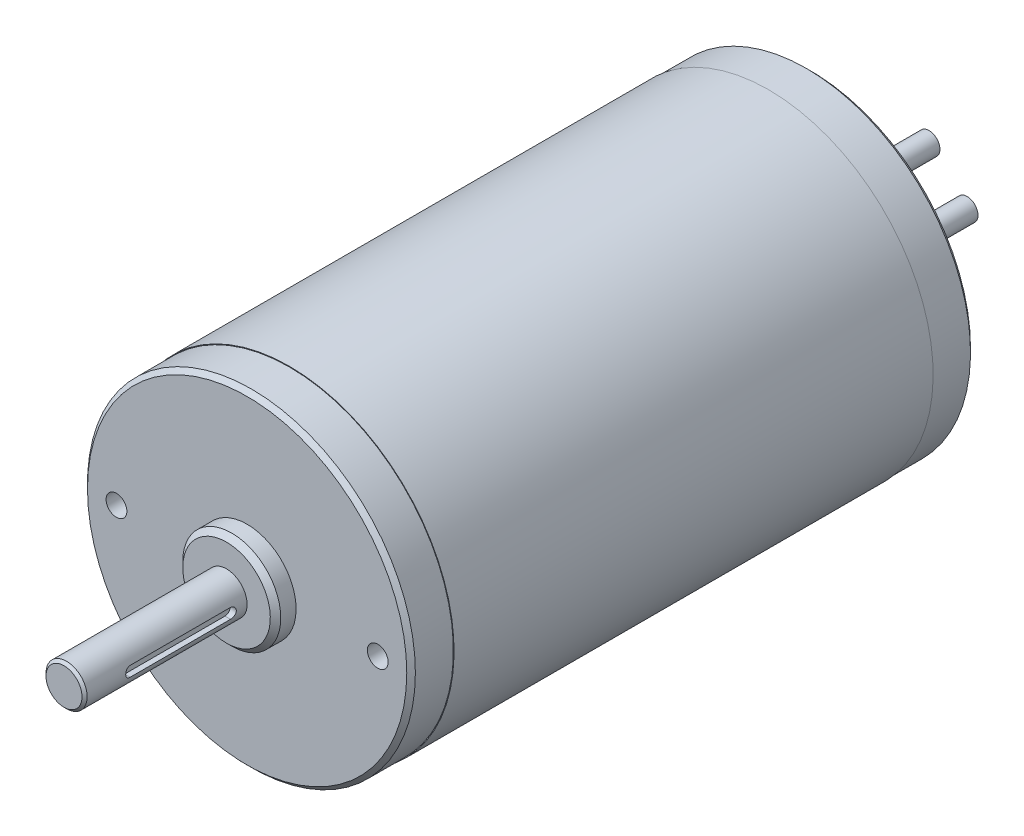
ISO-10303-21;
HEADER;
FILE_DESCRIPTION(('STEP AP214'),'2;1');
FILE_NAME('part.step','',(''),(''),'','','');
FILE_SCHEMA(('AUTOMOTIVE_DESIGN { 1 0 10303 214 1 1 1 1 }'));
ENDSEC;
DATA;
#1=APPLICATION_CONTEXT('core data for automotive mechanical design processes');
#2=APPLICATION_PROTOCOL_DEFINITION('international standard','automotive_design',2000,#1);
#3=PRODUCT_CONTEXT('',#1,'mechanical');
#4=PRODUCT('Part','Part','',(#3));
#5=PRODUCT_RELATED_PRODUCT_CATEGORY('part','',(#4));
#6=PRODUCT_DEFINITION_FORMATION('','',#4);
#7=PRODUCT_DEFINITION_CONTEXT('part definition',#1,'design');
#8=PRODUCT_DEFINITION('design','',#6,#7);
#9=PRODUCT_DEFINITION_SHAPE('','',#8);
#10=(LENGTH_UNIT() NAMED_UNIT(*) SI_UNIT(.MILLI.,.METRE.));
#11=(NAMED_UNIT(*) PLANE_ANGLE_UNIT() SI_UNIT($,.RADIAN.));
#12=(NAMED_UNIT(*) SI_UNIT($,.STERADIAN.) SOLID_ANGLE_UNIT());
#13=UNCERTAINTY_MEASURE_WITH_UNIT(LENGTH_MEASURE(1.E-05),#10,'distance_accuracy_value','');
#14=(GEOMETRIC_REPRESENTATION_CONTEXT(3) GLOBAL_UNCERTAINTY_ASSIGNED_CONTEXT((#13)) GLOBAL_UNIT_ASSIGNED_CONTEXT((#10,
#11,#12)) REPRESENTATION_CONTEXT('',''));
#15=CARTESIAN_POINT('',(0.,0.,0.));
#16=DIRECTION('',(0.,0.,1.));
#17=DIRECTION('',(1.,0.,0.));
#18=AXIS2_PLACEMENT_3D('',#15,#16,#17);
#19=CARTESIAN_POINT('',(18.6070906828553,11.2073596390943,-121.3729));
#20=DIRECTION('',(0.,0.,-1.));
#21=DIRECTION('',(0.,-1.,0.));
#22=AXIS2_PLACEMENT_3D('',#19,#20,#21);
#23=PLANE('',#22);
#24=CARTESIAN_POINT('',(11.2073596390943,18.6070906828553,-121.3729));
#25=DIRECTION('',(0.,0.,-1.));
#26=DIRECTION('',(0.,1.,0.));
#27=AXIS2_PLACEMENT_3D('',#24,#25,#26);
#28=CIRCLE('',#27,2.118);
#29=CARTESIAN_POINT('',(11.2073596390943,20.7250906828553,-121.3729));
#30=VERTEX_POINT('',#29);
#31=EDGE_CURVE('E11',#30,#30,#28,.T.);
#32=ORIENTED_EDGE('',*,*,#31,.T.);
#33=EDGE_LOOP('',(#32));
#34=FACE_BOUND('',#33,.T.);
#35=ADVANCED_FACE('F17',(#34),#23,.T.);
#36=CARTESIAN_POINT('',(11.2073596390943,18.6070906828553,-121.3729));
#37=DIRECTION('',(0.,0.,1.));
#38=DIRECTION('',(1.,0.,0.));
#39=AXIS2_PLACEMENT_3D('',#36,#37,#38);
#40=CYLINDRICAL_SURFACE('',#39,2.118);
#41=CARTESIAN_POINT('',(11.2073596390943,18.6070906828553,-111.8479));
#42=DIRECTION('',(0.,0.,-1.));
#43=DIRECTION('',(0.,1.,0.));
#44=AXIS2_PLACEMENT_3D('',#41,#42,#43);
#45=CIRCLE('',#44,2.118);
#46=CARTESIAN_POINT('',(11.2073596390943,20.7250906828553,-111.8479));
#47=VERTEX_POINT('',#46);
#48=EDGE_CURVE('E247',#47,#47,#45,.T.);
#49=ORIENTED_EDGE('',*,*,#48,.T.);
#50=EDGE_LOOP('',(#49));
#51=FACE_BOUND('',#50,.T.);
#52=ORIENTED_EDGE('',*,*,#31,.F.);
#53=EDGE_LOOP('',(#52));
#54=FACE_BOUND('',#53,.T.);
#55=ADVANCED_FACE('F424',(#51,#54),#40,.T.);
#56=CARTESIAN_POINT('',(18.6070906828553,11.2073596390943,-121.3729));
#57=DIRECTION('',(0.,0.,-1.));
#58=DIRECTION('',(0.,-1.,0.));
#59=AXIS2_PLACEMENT_3D('',#56,#57,#58);
#60=PLANE('',#59);
#61=CARTESIAN_POINT('',(18.6070906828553,11.2073596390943,-121.3729));
#62=DIRECTION('',(0.,0.,-1.));
#63=DIRECTION('',(0.,1.,0.));
#64=AXIS2_PLACEMENT_3D('',#61,#62,#63);
#65=CIRCLE('',#64,2.118);
#66=CARTESIAN_POINT('',(18.6070906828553,13.3253596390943,-121.3729));
#67=VERTEX_POINT('',#66);
#68=EDGE_CURVE('E26',#67,#67,#65,.T.);
#69=ORIENTED_EDGE('',*,*,#68,.T.);
#70=EDGE_LOOP('',(#69));
#71=FACE_BOUND('',#70,.T.);
#72=ADVANCED_FACE('F430',(#71),#60,.T.);
#73=CARTESIAN_POINT('',(18.6070906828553,11.2073596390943,-121.3729));
#74=DIRECTION('',(0.,0.,1.));
#75=DIRECTION('',(1.,0.,0.));
#76=AXIS2_PLACEMENT_3D('',#73,#74,#75);
#77=CYLINDRICAL_SURFACE('',#76,2.118);
#78=CARTESIAN_POINT('',(18.6070906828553,11.2073596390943,-111.8479));
#79=DIRECTION('',(0.,0.,-1.));
#80=DIRECTION('',(0.,1.,0.));
#81=AXIS2_PLACEMENT_3D('',#78,#79,#80);
#82=CIRCLE('',#81,2.118);
#83=CARTESIAN_POINT('',(18.6070906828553,13.3253596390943,-111.8479));
#84=VERTEX_POINT('',#83);
#85=EDGE_CURVE('E244',#84,#84,#82,.T.);
#86=ORIENTED_EDGE('',*,*,#85,.T.);
#87=EDGE_LOOP('',(#86));
#88=FACE_BOUND('',#87,.T.);
#89=ORIENTED_EDGE('',*,*,#68,.F.);
#90=EDGE_LOOP('',(#89));
#91=FACE_BOUND('',#90,.T.);
#92=ADVANCED_FACE('F436',(#88,#91),#77,.T.);
#93=CARTESIAN_POINT('',(0.,0.,-13.6144));
#94=DIRECTION('',(0.,0.,1.));
#95=DIRECTION('',(1.,0.,0.));
#96=AXIS2_PLACEMENT_3D('',#93,#94,#95);
#97=PLANE('',#96);
#98=CARTESIAN_POINT('',(-25.4,0.,-13.6144));
#99=DIRECTION('',(0.,0.,1.));
#100=DIRECTION('',(0.,-1.,0.));
#101=AXIS2_PLACEMENT_3D('',#98,#99,#100);
#102=CIRCLE('',#101,2.0193);
#103=CARTESIAN_POINT('',(-25.4,-2.0193,-13.6144));
#104=VERTEX_POINT('',#103);
#105=EDGE_CURVE('E233',#104,#104,#102,.T.);
#106=ORIENTED_EDGE('',*,*,#105,.T.);
#107=EDGE_LOOP('',(#106));
#108=FACE_BOUND('',#107,.T.);
#109=ADVANCED_FACE('F278',(#108),#97,.T.);
#110=CARTESIAN_POINT('',(0.,0.,-13.6144));
#111=DIRECTION('',(0.,0.,1.));
#112=DIRECTION('',(1.,0.,0.));
#113=AXIS2_PLACEMENT_3D('',#110,#111,#112);
#114=PLANE('',#113);
#115=CARTESIAN_POINT('',(25.4,0.,-13.6144));
#116=DIRECTION('',(0.,0.,1.));
#117=DIRECTION('',(0.,-1.,0.));
#118=AXIS2_PLACEMENT_3D('',#115,#116,#117);
#119=CIRCLE('',#118,2.0193);
#120=CARTESIAN_POINT('',(25.4,-2.0193,-13.6144));
#121=VERTEX_POINT('',#120);
#122=EDGE_CURVE('E236',#121,#121,#119,.T.);
#123=ORIENTED_EDGE('',*,*,#122,.T.);
#124=EDGE_LOOP('',(#123));
#125=FACE_BOUND('',#124,.T.);
#126=ADVANCED_FACE('F274',(#125),#114,.T.);
#127=CARTESIAN_POINT('',(0.,0.,-108.7618));
#128=DIRECTION('',(0.,0.,1.));
#129=DIRECTION('',(1.,0.,0.));
#130=AXIS2_PLACEMENT_3D('',#127,#128,#129);
#131=CONICAL_SURFACE('',#130,31.877,0.78539816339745);
#132=CARTESIAN_POINT('',(0.,0.,-108.7618));
#133=DIRECTION('',(0.,0.,1.));
#134=DIRECTION('',(-1.,0.,0.));
#135=AXIS2_PLACEMENT_3D('',#132,#133,#134);
#136=CIRCLE('',#135,31.877);
#137=CARTESIAN_POINT('',(-31.877,0.,-108.7618));
#138=VERTEX_POINT('',#137);
#139=EDGE_CURVE('E229',#138,#138,#136,.T.);
#140=ORIENTED_EDGE('',*,*,#139,.F.);
#141=EDGE_LOOP('',(#140));
#142=FACE_BOUND('',#141,.T.);
#143=CARTESIAN_POINT('',(0.,0.,-109.6));
#144=DIRECTION('',(0.,0.,-1.));
#145=DIRECTION('',(-1.,0.,0.));
#146=AXIS2_PLACEMENT_3D('',#143,#144,#145);
#147=CIRCLE('',#146,31.0388);
#148=CARTESIAN_POINT('',(-31.0388,0.,-109.6));
#149=VERTEX_POINT('',#148);
#150=EDGE_CURVE('E209',#149,#149,#147,.T.);
#151=ORIENTED_EDGE('',*,*,#150,.F.);
#152=EDGE_LOOP('',(#151));
#153=FACE_BOUND('',#152,.T.);
#154=ADVANCED_FACE('F277',(#142,#153),#131,.T.);
#155=CARTESIAN_POINT('',(0.,0.,-0.8382));
#156=DIRECTION('',(0.,0.,-1.));
#157=DIRECTION('',(-1.,0.,0.));
#158=AXIS2_PLACEMENT_3D('',#155,#156,#157);
#159=CONICAL_SURFACE('',#158,31.877,0.785398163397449);
#160=CARTESIAN_POINT('',(0.,0.,-0.8382));
#161=DIRECTION('',(0.,0.,-1.));
#162=DIRECTION('',(1.,0.,0.));
#163=AXIS2_PLACEMENT_3D('',#160,#161,#162);
#164=CIRCLE('',#163,31.877);
#165=CARTESIAN_POINT('',(31.877,0.,-0.8382));
#166=VERTEX_POINT('',#165);
#167=EDGE_CURVE('E232',#166,#166,#164,.T.);
#168=ORIENTED_EDGE('',*,*,#167,.F.);
#169=EDGE_LOOP('',(#168));
#170=FACE_BOUND('',#169,.T.);
#171=CARTESIAN_POINT('',(0.,0.,0.));
#172=DIRECTION('',(0.,0.,1.));
#173=DIRECTION('',(1.,0.,0.));
#174=AXIS2_PLACEMENT_3D('',#171,#172,#173);
#175=CIRCLE('',#174,31.0388);
#176=CARTESIAN_POINT('',(31.0388,0.,0.));
#177=VERTEX_POINT('',#176);
#178=EDGE_CURVE('E364',#177,#177,#175,.T.);
#179=ORIENTED_EDGE('',*,*,#178,.F.);
#180=EDGE_LOOP('',(#179));
#181=FACE_BOUND('',#180,.T.);
#182=ADVANCED_FACE('F409',(#170,#181),#159,.T.);
#183=CARTESIAN_POINT('',(0.,0.,35.1));
#184=DIRECTION('',(0.,0.,-1.));
#185=DIRECTION('',(0.,1.,0.));
#186=AXIS2_PLACEMENT_3D('',#183,#184,#185);
#187=CONICAL_SURFACE('',#186,4.,0.785398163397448);
#188=CARTESIAN_POINT('',(0.,0.,35.6));
#189=DIRECTION('',(0.,0.,1.));
#190=DIRECTION('',(0.,-1.,0.));
#191=AXIS2_PLACEMENT_3D('',#188,#189,#190);
#192=CIRCLE('',#191,3.5);
#193=CARTESIAN_POINT('',(0.,-3.5,35.6));
#194=VERTEX_POINT('',#193);
#195=EDGE_CURVE('E206',#194,#194,#192,.T.);
#196=ORIENTED_EDGE('',*,*,#195,.F.);
#197=EDGE_LOOP('',(#196));
#198=FACE_BOUND('',#197,.T.);
#199=CARTESIAN_POINT('',(0.,0.,35.1));
#200=DIRECTION('',(0.,0.,-1.));
#201=DIRECTION('',(0.,-1.,0.));
#202=AXIS2_PLACEMENT_3D('',#199,#200,#201);
#203=CIRCLE('',#202,4.);
#204=CARTESIAN_POINT('',(0.,-4.,35.1));
#205=VERTEX_POINT('',#204);
#206=EDGE_CURVE('E222',#205,#205,#203,.T.);
#207=ORIENTED_EDGE('',*,*,#206,.F.);
#208=EDGE_LOOP('',(#207));
#209=FACE_BOUND('',#208,.T.);
#210=ADVANCED_FACE('F418',(#198,#209),#187,.T.);
#211=CARTESIAN_POINT('',(0.,0.,2.984));
#212=DIRECTION('',(0.,0.,-1.));
#213=DIRECTION('',(0.,1.,0.));
#214=AXIS2_PLACEMENT_3D('',#211,#212,#213);
#215=CONICAL_SURFACE('',#214,9.525,0.78539816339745);
#216=CARTESIAN_POINT('',(0.,0.,4.));
#217=DIRECTION('',(0.,0.,1.));
#218=DIRECTION('',(0.,-1.,0.));
#219=AXIS2_PLACEMENT_3D('',#216,#217,#218);
#220=CIRCLE('',#219,8.509);
#221=CARTESIAN_POINT('',(0.,-8.509,4.));
#222=VERTEX_POINT('',#221);
#223=EDGE_CURVE('E357',#222,#222,#220,.T.);
#224=ORIENTED_EDGE('',*,*,#223,.F.);
#225=EDGE_LOOP('',(#224));
#226=FACE_BOUND('',#225,.T.);
#227=CARTESIAN_POINT('',(0.,0.,2.984));
#228=DIRECTION('',(0.,0.,-1.));
#229=DIRECTION('',(0.,-1.,0.));
#230=AXIS2_PLACEMENT_3D('',#227,#228,#229);
#231=CIRCLE('',#230,9.525);
#232=CARTESIAN_POINT('',(0.,-9.525,2.984));
#233=VERTEX_POINT('',#232);
#234=EDGE_CURVE('E237',#233,#233,#231,.T.);
#235=ORIENTED_EDGE('',*,*,#234,.F.);
#236=EDGE_LOOP('',(#235));
#237=FACE_BOUND('',#236,.T.);
#238=ADVANCED_FACE('F452',(#226,#237),#215,.T.);
#239=CARTESIAN_POINT('',(0.,0.,-114.6));
#240=DIRECTION('',(0.,0.,1.));
#241=DIRECTION('',(0.,-1.,0.));
#242=AXIS2_PLACEMENT_3D('',#239,#240,#241);
#243=CONICAL_SURFACE('',#242,14.0208,0.78539816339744);
#244=CARTESIAN_POINT('',(0.,0.,-114.6));
#245=DIRECTION('',(0.,0.,-1.));
#246=DIRECTION('',(0.,1.,0.));
#247=AXIS2_PLACEMENT_3D('',#244,#245,#246);
#248=CIRCLE('',#247,14.0208);
#249=CARTESIAN_POINT('',(0.,14.0208,-114.6));
#250=VERTEX_POINT('',#249);
#251=EDGE_CURVE('E203',#250,#250,#248,.T.);
#252=ORIENTED_EDGE('',*,*,#251,.F.);
#253=EDGE_LOOP('',(#252));
#254=FACE_BOUND('',#253,.T.);
#255=CARTESIAN_POINT('',(0.,0.,-113.584));
#256=DIRECTION('',(0.,0.,1.));
#257=DIRECTION('',(0.,1.,0.));
#258=AXIS2_PLACEMENT_3D('',#255,#256,#257);
#259=CIRCLE('',#258,15.0368);
#260=CARTESIAN_POINT('',(0.,15.0368,-113.584));
#261=VERTEX_POINT('',#260);
#262=EDGE_CURVE('E225',#261,#261,#259,.T.);
#263=ORIENTED_EDGE('',*,*,#262,.F.);
#264=EDGE_LOOP('',(#263));
#265=FACE_BOUND('',#264,.T.);
#266=ADVANCED_FACE('F284',(#254,#265),#243,.T.);
#267=CARTESIAN_POINT('',(11.2073596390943,18.6070906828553,-111.8479));
#268=DIRECTION('',(0.,0.,1.));
#269=DIRECTION('',(0.,-1.,0.));
#270=AXIS2_PLACEMENT_3D('',#267,#268,#269);
#271=CONICAL_SURFACE('',#270,2.118,0.785398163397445);
#272=ORIENTED_EDGE('',*,*,#48,.F.);
#273=EDGE_LOOP('',(#272));
#274=FACE_BOUND('',#273,.T.);
#275=CARTESIAN_POINT('',(11.2073596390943,18.6070906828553,-109.6479));
#276=DIRECTION('',(0.,0.,1.));
#277=DIRECTION('',(0.,1.,0.));
#278=AXIS2_PLACEMENT_3D('',#275,#276,#277);
#279=CIRCLE('',#278,4.318);
#280=CARTESIAN_POINT('',(11.2073596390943,22.9250906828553,-109.6479));
#281=VERTEX_POINT('',#280);
#282=EDGE_CURVE('E243',#281,#281,#279,.T.);
#283=ORIENTED_EDGE('',*,*,#282,.F.);
#284=EDGE_LOOP('',(#283));
#285=FACE_BOUND('',#284,.T.);
#286=ADVANCED_FACE('F280',(#274,#285),#271,.T.);
#287=CARTESIAN_POINT('',(18.6070906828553,11.2073596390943,-111.8479));
#288=DIRECTION('',(0.,0.,1.));
#289=DIRECTION('',(0.,-1.,0.));
#290=AXIS2_PLACEMENT_3D('',#287,#288,#289);
#291=CONICAL_SURFACE('',#290,2.118,0.785398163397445);
#292=ORIENTED_EDGE('',*,*,#85,.F.);
#293=EDGE_LOOP('',(#292));
#294=FACE_BOUND('',#293,.T.);
#295=CARTESIAN_POINT('',(18.6070906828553,11.2073596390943,-109.6479));
#296=DIRECTION('',(0.,0.,1.));
#297=DIRECTION('',(0.,1.,0.));
#298=AXIS2_PLACEMENT_3D('',#295,#296,#297);
#299=CIRCLE('',#298,4.318);
#300=CARTESIAN_POINT('',(18.6070906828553,15.5253596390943,-109.6479));
#301=VERTEX_POINT('',#300);
#302=EDGE_CURVE('E240',#301,#301,#299,.T.);
#303=ORIENTED_EDGE('',*,*,#302,.F.);
#304=EDGE_LOOP('',(#303));
#305=FACE_BOUND('',#304,.T.);
#306=ADVANCED_FACE('F283',(#294,#305),#291,.T.);
#307=CARTESIAN_POINT('',(11.2073596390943,18.6070906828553,-111.8479));
#308=DIRECTION('',(0.,0.,1.));
#309=DIRECTION('',(0.,-1.,0.));
#310=AXIS2_PLACEMENT_3D('',#307,#308,#309);
#311=CYLINDRICAL_SURFACE('',#310,4.318);
#312=ORIENTED_EDGE('',*,*,#282,.T.);
#313=EDGE_LOOP('',(#312));
#314=FACE_BOUND('',#313,.T.);
#315=CARTESIAN_POINT('',(11.2073596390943,18.6070906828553,-109.6));
#316=DIRECTION('',(0.,0.,-1.));
#317=DIRECTION('',(0.,1.,0.));
#318=AXIS2_PLACEMENT_3D('',#315,#316,#317);
#319=CIRCLE('',#318,4.318);
#320=CARTESIAN_POINT('',(11.2073596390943,22.9250906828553,-109.6));
#321=VERTEX_POINT('',#320);
#322=EDGE_CURVE('E214',#321,#321,#319,.T.);
#323=ORIENTED_EDGE('',*,*,#322,.T.);
#324=EDGE_LOOP('',(#323));
#325=FACE_BOUND('',#324,.T.);
#326=ADVANCED_FACE('F393',(#314,#325),#311,.T.);
#327=CARTESIAN_POINT('',(18.6070906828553,11.2073596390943,-111.8479));
#328=DIRECTION('',(0.,0.,1.));
#329=DIRECTION('',(0.,-1.,0.));
#330=AXIS2_PLACEMENT_3D('',#327,#328,#329);
#331=CYLINDRICAL_SURFACE('',#330,4.318);
#332=ORIENTED_EDGE('',*,*,#302,.T.);
#333=EDGE_LOOP('',(#332));
#334=FACE_BOUND('',#333,.T.);
#335=CARTESIAN_POINT('',(18.6070906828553,11.2073596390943,-109.6));
#336=DIRECTION('',(0.,0.,-1.));
#337=DIRECTION('',(0.,1.,0.));
#338=AXIS2_PLACEMENT_3D('',#335,#336,#337);
#339=CIRCLE('',#338,4.318);
#340=CARTESIAN_POINT('',(18.6070906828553,15.5253596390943,-109.6));
#341=VERTEX_POINT('',#340);
#342=EDGE_CURVE('E213',#341,#341,#339,.T.);
#343=ORIENTED_EDGE('',*,*,#342,.T.);
#344=EDGE_LOOP('',(#343));
#345=FACE_BOUND('',#344,.T.);
#346=ADVANCED_FACE('F397',(#334,#345),#331,.T.);
#347=CARTESIAN_POINT('',(25.4,0.,0.));
#348=DIRECTION('',(0.,0.,1.));
#349=DIRECTION('',(0.,-1.,0.));
#350=AXIS2_PLACEMENT_3D('',#347,#348,#349);
#351=CYLINDRICAL_SURFACE('',#350,2.0193);
#352=ORIENTED_EDGE('',*,*,#122,.F.);
#353=EDGE_LOOP('',(#352));
#354=FACE_BOUND('',#353,.T.);
#355=CARTESIAN_POINT('',(25.4,0.,0.));
#356=DIRECTION('',(0.,0.,1.));
#357=DIRECTION('',(0.,-1.,0.));
#358=AXIS2_PLACEMENT_3D('',#355,#356,#357);
#359=CIRCLE('',#358,2.0193);
#360=CARTESIAN_POINT('',(25.4,-2.0193,0.));
#361=VERTEX_POINT('',#360);
#362=EDGE_CURVE('E197',#361,#361,#359,.T.);
#363=ORIENTED_EDGE('',*,*,#362,.T.);
#364=EDGE_LOOP('',(#363));
#365=FACE_BOUND('',#364,.T.);
#366=ADVANCED_FACE('F372',(#354,#365),#351,.F.);
#367=CARTESIAN_POINT('',(-25.4,0.,0.));
#368=DIRECTION('',(0.,0.,1.));
#369=DIRECTION('',(0.,-1.,0.));
#370=AXIS2_PLACEMENT_3D('',#367,#368,#369);
#371=CYLINDRICAL_SURFACE('',#370,2.0193);
#372=ORIENTED_EDGE('',*,*,#105,.F.);
#373=EDGE_LOOP('',(#372));
#374=FACE_BOUND('',#373,.T.);
#375=CARTESIAN_POINT('',(-25.4,0.,0.));
#376=DIRECTION('',(0.,0.,1.));
#377=DIRECTION('',(0.,-1.,0.));
#378=AXIS2_PLACEMENT_3D('',#375,#376,#377);
#379=CIRCLE('',#378,2.0193);
#380=CARTESIAN_POINT('',(-25.4,-2.0193,0.));
#381=VERTEX_POINT('',#380);
#382=EDGE_CURVE('E358',#381,#381,#379,.T.);
#383=ORIENTED_EDGE('',*,*,#382,.T.);
#384=EDGE_LOOP('',(#383));
#385=FACE_BOUND('',#384,.T.);
#386=ADVANCED_FACE('F465',(#374,#385),#371,.F.);
#387=CARTESIAN_POINT('',(0.,0.,0.));
#388=DIRECTION('',(0.,0.,-1.));
#389=DIRECTION('',(0.,1.,0.));
#390=AXIS2_PLACEMENT_3D('',#387,#388,#389);
#391=CYLINDRICAL_SURFACE('',#390,9.525);
#392=ORIENTED_EDGE('',*,*,#234,.T.);
#393=EDGE_LOOP('',(#392));
#394=FACE_BOUND('',#393,.T.);
#395=CARTESIAN_POINT('',(0.,0.,0.));
#396=DIRECTION('',(0.,0.,-1.));
#397=DIRECTION('',(0.,1.,0.));
#398=AXIS2_PLACEMENT_3D('',#395,#396,#397);
#399=CIRCLE('',#398,9.525);
#400=CARTESIAN_POINT('',(0.,9.525,0.));
#401=VERTEX_POINT('',#400);
#402=EDGE_CURVE('E361',#401,#401,#399,.T.);
#403=ORIENTED_EDGE('',*,*,#402,.F.);
#404=EDGE_LOOP('',(#403));
#405=FACE_BOUND('',#404,.T.);
#406=ADVANCED_FACE('F469',(#394,#405),#391,.T.);
#407=CARTESIAN_POINT('',(0.,0.,0.));
#408=DIRECTION('',(0.,0.,-1.));
#409=DIRECTION('',(0.,1.,0.));
#410=AXIS2_PLACEMENT_3D('',#407,#408,#409);
#411=CYLINDRICAL_SURFACE('',#410,31.877);
#412=CARTESIAN_POINT('',(0.,0.,-8.2296));
#413=DIRECTION('',(0.,0.,-1.));
#414=DIRECTION('',(0.,1.,0.));
#415=AXIS2_PLACEMENT_3D('',#412,#413,#414);
#416=CIRCLE('',#415,31.877);
#417=CARTESIAN_POINT('',(0.,31.877,-8.2296));
#418=VERTEX_POINT('',#417);
#419=EDGE_CURVE('E184',#418,#418,#416,.T.);
#420=ORIENTED_EDGE('',*,*,#419,.F.);
#421=EDGE_LOOP('',(#420));
#422=FACE_BOUND('',#421,.T.);
#423=ORIENTED_EDGE('',*,*,#167,.T.);
#424=EDGE_LOOP('',(#423));
#425=FACE_BOUND('',#424,.T.);
#426=ADVANCED_FACE('F473',(#422,#425),#411,.T.);
#427=CARTESIAN_POINT('',(0.,0.,0.));
#428=DIRECTION('',(0.,0.,-1.));
#429=DIRECTION('',(0.,1.,0.));
#430=AXIS2_PLACEMENT_3D('',#427,#428,#429);
#431=CYLINDRICAL_SURFACE('',#430,32.004);
#432=CARTESIAN_POINT('',(0.,0.,-8.2296));
#433=DIRECTION('',(0.,0.,-1.));
#434=DIRECTION('',(0.,1.,0.));
#435=AXIS2_PLACEMENT_3D('',#432,#433,#434);
#436=CIRCLE('',#435,32.004);
#437=CARTESIAN_POINT('',(0.,32.004,-8.2296));
#438=VERTEX_POINT('',#437);
#439=EDGE_CURVE('E190',#438,#438,#436,.T.);
#440=ORIENTED_EDGE('',*,*,#439,.T.);
#441=EDGE_LOOP('',(#440));
#442=FACE_BOUND('',#441,.T.);
#443=CARTESIAN_POINT('',(0.,0.,-101.3704));
#444=DIRECTION('',(0.,0.,-1.));
#445=DIRECTION('',(0.,1.,0.));
#446=AXIS2_PLACEMENT_3D('',#443,#444,#445);
#447=CIRCLE('',#446,32.004);
#448=CARTESIAN_POINT('',(0.,32.004,-101.3704));
#449=VERTEX_POINT('',#448);
#450=EDGE_CURVE('E195',#449,#449,#447,.T.);
#451=ORIENTED_EDGE('',*,*,#450,.F.);
#452=EDGE_LOOP('',(#451));
#453=FACE_BOUND('',#452,.T.);
#454=ADVANCED_FACE('F477',(#442,#453),#431,.T.);
#455=CARTESIAN_POINT('',(0.,0.,0.));
#456=DIRECTION('',(0.,0.,-1.));
#457=DIRECTION('',(0.,1.,0.));
#458=AXIS2_PLACEMENT_3D('',#455,#456,#457);
#459=CYLINDRICAL_SURFACE('',#458,31.877);
#460=CARTESIAN_POINT('',(0.,0.,-101.3704));
#461=DIRECTION('',(0.,0.,-1.));
#462=DIRECTION('',(0.,1.,0.));
#463=AXIS2_PLACEMENT_3D('',#460,#461,#462);
#464=CIRCLE('',#463,31.877);
#465=CARTESIAN_POINT('',(0.,31.877,-101.3704));
#466=VERTEX_POINT('',#465);
#467=EDGE_CURVE('E189',#466,#466,#464,.T.);
#468=ORIENTED_EDGE('',*,*,#467,.T.);
#469=EDGE_LOOP('',(#468));
#470=FACE_BOUND('',#469,.T.);
#471=ORIENTED_EDGE('',*,*,#139,.T.);
#472=EDGE_LOOP('',(#471));
#473=FACE_BOUND('',#472,.T.);
#474=ADVANCED_FACE('F480',(#470,#473),#459,.T.);
#475=CARTESIAN_POINT('',(0.,0.,0.));
#476=DIRECTION('',(0.,0.,-1.));
#477=DIRECTION('',(0.,1.,0.));
#478=AXIS2_PLACEMENT_3D('',#475,#476,#477);
#479=CYLINDRICAL_SURFACE('',#478,15.0368);
#480=CARTESIAN_POINT('',(0.,0.,-109.6));
#481=DIRECTION('',(0.,0.,-1.));
#482=DIRECTION('',(0.,1.,0.));
#483=AXIS2_PLACEMENT_3D('',#480,#481,#482);
#484=CIRCLE('',#483,15.0368);
#485=CARTESIAN_POINT('',(0.,15.0368,-109.6));
#486=VERTEX_POINT('',#485);
#487=EDGE_CURVE('E210',#486,#486,#484,.T.);
#488=ORIENTED_EDGE('',*,*,#487,.T.);
#489=EDGE_LOOP('',(#488));
#490=FACE_BOUND('',#489,.T.);
#491=ORIENTED_EDGE('',*,*,#262,.T.);
#492=EDGE_LOOP('',(#491));
#493=FACE_BOUND('',#492,.T.);
#494=ADVANCED_FACE('F294',(#490,#493),#479,.T.);
#495=CARTESIAN_POINT('',(0.,0.,0.));
#496=DIRECTION('',(0.,0.,-1.));
#497=DIRECTION('',(0.,1.,0.));
#498=AXIS2_PLACEMENT_3D('',#495,#496,#497);
#499=CYLINDRICAL_SURFACE('',#498,4.);
#500=CARTESIAN_POINT('',(3.87298334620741,1.,26.6));
#501=CARTESIAN_POINT('',(3.87298476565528,1.00000011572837,26.6111994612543));
#502=CARTESIAN_POINT('',(3.87307206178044,0.999811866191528,26.62239856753));
#503=CARTESIAN_POINT('',(3.87340472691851,0.999036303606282,26.6454723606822));
#504=CARTESIAN_POINT('',(3.87365951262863,0.998425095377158,26.6573461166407));
#505=CARTESIAN_POINT('',(3.87432664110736,0.996732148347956,26.6817511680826));
#506=CARTESIAN_POINT('',(3.87474729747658,0.995625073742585,26.6942804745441));
#507=CARTESIAN_POINT('',(3.87574755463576,0.992865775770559,26.7199731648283));
#508=CARTESIAN_POINT('',(3.87633464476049,0.991186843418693,26.7331333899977));
#509=CARTESIAN_POINT('',(3.87766841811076,0.987206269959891,26.7600579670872));
#510=CARTESIAN_POINT('',(3.87842185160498,0.984876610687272,26.7738178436));
#511=CARTESIAN_POINT('',(3.8800890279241,0.97951466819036,26.8019046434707));
#512=CARTESIAN_POINT('',(3.88100889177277,0.976453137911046,26.8162256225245));
#513=CARTESIAN_POINT('',(3.88300950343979,0.969545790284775,26.8453896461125));
#514=CARTESIAN_POINT('',(3.88409582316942,0.965669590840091,26.8602251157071));
#515=CARTESIAN_POINT('',(3.88642986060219,0.957050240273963,26.8903645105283));
#516=CARTESIAN_POINT('',(3.88768267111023,0.952275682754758,26.9056590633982));
#517=CARTESIAN_POINT('',(3.89035013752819,0.941776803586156,26.9366536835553));
#518=CARTESIAN_POINT('',(3.89176946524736,0.936020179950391,26.9523424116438));
#519=CARTESIAN_POINT('',(3.89477035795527,0.923475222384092,26.9840524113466));
#520=CARTESIAN_POINT('',(3.89635622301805,0.91665384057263,27.0000602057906));
#521=CARTESIAN_POINT('',(3.899690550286,0.901899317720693,27.0323248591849));
#522=CARTESIAN_POINT('',(3.90144298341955,0.893932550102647,27.0485659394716));
#523=CARTESIAN_POINT('',(3.90511071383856,0.876810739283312,27.081202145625));
#524=CARTESIAN_POINT('',(3.90702968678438,0.867621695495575,27.0975790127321));
#525=CARTESIAN_POINT('',(3.91103094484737,0.847982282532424,27.1303818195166));
#526=CARTESIAN_POINT('',(3.91311664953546,0.837497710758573,27.1467869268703));
#527=CARTESIAN_POINT('',(3.9163388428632,0.820924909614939,27.1711235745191));
#528=CARTESIAN_POINT('',(3.91744348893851,0.815179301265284,27.1792947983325));
#529=CARTESIAN_POINT('',(3.91969413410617,0.803344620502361,27.1956010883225));
#530=CARTESIAN_POINT('',(3.92084051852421,0.797251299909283,27.2037330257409));
#531=CARTESIAN_POINT('',(3.92317448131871,0.784714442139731,27.2199435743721));
#532=CARTESIAN_POINT('',(3.92436242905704,0.778266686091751,27.2280188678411));
#533=CARTESIAN_POINT('',(3.92678000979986,0.76501459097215,27.2440986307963));
#534=CARTESIAN_POINT('',(3.92801000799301,0.758206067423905,27.2520995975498));
#535=CARTESIAN_POINT('',(3.93050991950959,0.744226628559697,27.2680125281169));
#536=CARTESIAN_POINT('',(3.93178015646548,0.737051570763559,27.2759208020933));
#537=CARTESIAN_POINT('',(3.93436736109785,0.722334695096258,27.2916287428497));
#538=CARTESIAN_POINT('',(3.93568475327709,0.714788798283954,27.2994245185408));
#539=CARTESIAN_POINT('',(3.9382979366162,0.699570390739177,27.3146434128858));
#540=CARTESIAN_POINT('',(3.93959373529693,0.691901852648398,27.3220705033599));
#541=CARTESIAN_POINT('',(3.94213855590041,0.676448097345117,27.336565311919));
#542=CARTESIAN_POINT('',(3.9433879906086,0.668666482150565,27.3436367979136));
#543=CARTESIAN_POINT('',(3.94584698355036,0.653005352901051,27.357424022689));
#544=CARTESIAN_POINT('',(3.94705685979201,0.645129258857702,27.3641435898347));
#545=CARTESIAN_POINT('',(3.94943491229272,0.629296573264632,27.3772320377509));
#546=CARTESIAN_POINT('',(3.95060344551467,0.621343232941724,27.3836047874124));
#547=CARTESIAN_POINT('',(3.9528992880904,0.605372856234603,27.3960051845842));
#548=CARTESIAN_POINT('',(3.95402695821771,0.597358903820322,27.4020367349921));
#549=CARTESIAN_POINT('',(3.95624088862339,0.581283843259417,27.413760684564));
#550=CARTESIAN_POINT('',(3.9573275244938,0.573225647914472,27.4194570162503));
#551=CARTESIAN_POINT('',(3.96049862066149,0.549206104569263,27.4359084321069));
#552=CARTESIAN_POINT('',(3.9625503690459,0.53300897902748,27.4463286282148));
#553=CARTESIAN_POINT('',(3.96648662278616,0.500593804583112,27.465882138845));
#554=CARTESIAN_POINT('',(3.96837444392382,0.484395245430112,27.4750471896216));
#555=CARTESIAN_POINT('',(3.97198279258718,0.452082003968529,27.4921570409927));
#556=CARTESIAN_POINT('',(3.9737068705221,0.435984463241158,27.5001334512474));
#557=CARTESIAN_POINT('',(3.97698743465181,0.403968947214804,27.5149364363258));
#558=CARTESIAN_POINT('',(3.97854774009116,0.388065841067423,27.5217943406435));
#559=CARTESIAN_POINT('',(3.98150048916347,0.356523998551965,27.534434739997));
#560=CARTESIAN_POINT('',(3.98289704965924,0.340898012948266,27.5402480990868));
#561=CARTESIAN_POINT('',(3.98552199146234,0.309985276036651,27.5508762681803));
#562=CARTESIAN_POINT('',(3.98675482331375,0.29470929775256,27.5557213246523));
#563=CARTESIAN_POINT('',(3.98905195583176,0.264561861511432,27.5644912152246));
#564=CARTESIAN_POINT('',(3.99012108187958,0.249699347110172,27.5684455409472));
#565=CARTESIAN_POINT('',(3.992090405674,0.220435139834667,27.575512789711));
#566=CARTESIAN_POINT('',(3.99299585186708,0.206040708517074,27.5786543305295));
#567=CARTESIAN_POINT('',(3.99463736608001,0.177760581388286,27.584174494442));
#568=CARTESIAN_POINT('',(3.99537916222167,0.163880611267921,27.5865807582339));
#569=CARTESIAN_POINT('',(3.9966928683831,0.136669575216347,27.5907077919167));
#570=CARTESIAN_POINT('',(3.99727105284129,0.123342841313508,27.5924551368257));
#571=CARTESIAN_POINT('',(3.99825694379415,0.0972713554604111,27.5953400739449));
#572=CARTESIAN_POINT('',(3.99867155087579,0.0845296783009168,27.5965030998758));
#573=CARTESIAN_POINT('',(3.9993296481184,0.0596549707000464,27.5982929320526));
#574=CARTESIAN_POINT('',(3.99958075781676,0.047523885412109,27.5989439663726));
#575=CARTESIAN_POINT('',(3.99991098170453,0.0238912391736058,27.5997807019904));
#576=CARTESIAN_POINT('',(3.9999985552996,0.0123906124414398,27.5999893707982));
#577=CARTESIAN_POINT('',(4.00000125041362,-0.0106421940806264,27.6000098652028));
#578=CARTESIAN_POINT('',(3.99991590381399,-0.0221743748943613,27.5998206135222));
#579=CARTESIAN_POINT('',(3.99959012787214,-0.0458703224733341,27.5990216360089));
#580=CARTESIAN_POINT('',(3.99934125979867,-0.058033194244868,27.5983888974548));
#581=CARTESIAN_POINT('',(3.99868742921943,-0.0829716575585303,27.5966344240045));
#582=CARTESIAN_POINT('',(3.99827485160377,-0.0957453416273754,27.5954884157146));
#583=CARTESIAN_POINT('',(3.99729286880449,-0.121880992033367,27.5926361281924));
#584=CARTESIAN_POINT('',(3.99671656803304,-0.135239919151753,27.5909043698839));
#585=CARTESIAN_POINT('',(3.99540646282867,-0.162515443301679,27.5868069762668));
#586=CARTESIAN_POINT('',(3.9946663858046,-0.176427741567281,27.5844147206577));
#587=CARTESIAN_POINT('',(3.99302815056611,-0.204772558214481,27.5789208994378));
#588=CARTESIAN_POINT('',(3.99212426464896,-0.219199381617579,27.5757916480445));
#589=CARTESIAN_POINT('',(3.99015790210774,-0.248528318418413,27.5687471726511));
#590=CARTESIAN_POINT('',(3.98909017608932,-0.26342319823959,27.5648032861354));
#591=CARTESIAN_POINT('',(3.98679568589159,-0.293635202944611,27.5560523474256));
#592=CARTESIAN_POINT('',(3.98556409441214,-0.308943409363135,27.5512157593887));
#593=CARTESIAN_POINT('',(3.98294147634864,-0.339920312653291,27.5406024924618));
#594=CARTESIAN_POINT('',(3.98154599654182,-0.355578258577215,27.5347955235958));
#595=CARTESIAN_POINT('',(3.97859525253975,-0.387183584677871,27.5221657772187));
#596=CARTESIAN_POINT('',(3.97703586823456,-0.403118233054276,27.5153120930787));
#597=CARTESIAN_POINT('',(3.97375699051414,-0.435196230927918,27.5005153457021));
#598=CARTESIAN_POINT('',(3.97203367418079,-0.451324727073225,27.4925409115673));
#599=CARTESIAN_POINT('',(3.96842669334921,-0.483699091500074,27.4754327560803));
#600=CARTESIAN_POINT('',(3.96653947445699,-0.499927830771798,27.4662673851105));
#601=CARTESIAN_POINT('',(3.9626042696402,-0.532402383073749,27.446710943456));
#602=CARTESIAN_POINT('',(3.96055296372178,-0.548628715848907,27.4362880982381));
#603=CARTESIAN_POINT('',(3.95738235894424,-0.572691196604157,27.4198307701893));
#604=CARTESIAN_POINT('',(3.95629588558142,-0.580763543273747,27.4141322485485));
#605=CARTESIAN_POINT('',(3.95408224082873,-0.596866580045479,27.4024033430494));
#606=CARTESIAN_POINT('',(3.95295469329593,-0.604894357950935,27.3963690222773));
#607=CARTESIAN_POINT('',(3.95065905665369,-0.620892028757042,27.3839625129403));
#608=CARTESIAN_POINT('',(3.94949060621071,-0.628858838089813,27.3775864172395));
#609=CARTESIAN_POINT('',(3.94711268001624,-0.644718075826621,27.364490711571));
#610=CARTESIAN_POINT('',(3.94590284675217,-0.65260725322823,27.357767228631));
#611=CARTESIAN_POINT('',(3.94344390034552,-0.668294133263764,27.3439716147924));
#612=CARTESIAN_POINT('',(3.94219446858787,-0.676088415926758,27.3368956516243));
#613=CARTESIAN_POINT('',(3.93964961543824,-0.691567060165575,27.3223913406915));
#614=CARTESIAN_POINT('',(3.93835378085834,-0.699247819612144,27.3149592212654));
#615=CARTESIAN_POINT('',(3.93573941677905,-0.714496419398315,27.2997235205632));
#616=CARTESIAN_POINT('',(3.93442087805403,-0.722060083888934,27.2919157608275));
#617=CARTESIAN_POINT('',(3.93183142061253,-0.736810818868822,27.2761835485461));
#618=CARTESIAN_POINT('',(3.93056007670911,-0.744001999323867,27.2682630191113));
#619=CARTESIAN_POINT('',(3.92805798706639,-0.758012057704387,27.2523254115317));
#620=CARTESIAN_POINT('',(3.92682691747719,-0.764835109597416,27.2443120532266));
#621=CARTESIAN_POINT('',(3.92440723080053,-0.778114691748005,27.2282074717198));
#622=CARTESIAN_POINT('',(3.9232182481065,-0.78457543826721,27.2201197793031));
#623=CARTESIAN_POINT('',(3.92088225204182,-0.797136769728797,27.2038845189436));
#624=CARTESIAN_POINT('',(3.91973486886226,-0.803241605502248,27.1957402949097));
#625=CARTESIAN_POINT('',(3.91748226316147,-0.815097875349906,27.1794096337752));
#626=CARTESIAN_POINT('',(3.91637665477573,-0.820853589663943,27.1712263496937));
#627=CARTESIAN_POINT('',(3.9131517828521,-0.83745374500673,27.1468552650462));
#628=CARTESIAN_POINT('',(3.91106425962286,-0.847954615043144,27.1304270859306));
#629=CARTESIAN_POINT('',(3.90705951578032,-0.86762162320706,27.0975800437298));
#630=CARTESIAN_POINT('',(3.90513886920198,-0.876822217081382,27.0811821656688));
#631=CARTESIAN_POINT('',(3.90146794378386,-0.893962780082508,27.0485064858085));
#632=CARTESIAN_POINT('',(3.89971398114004,-0.901936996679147,27.0322470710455));
#633=CARTESIAN_POINT('',(3.89637674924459,-0.91670273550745,26.9999488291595));
#634=CARTESIAN_POINT('',(3.89478949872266,-0.923528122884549,26.9839258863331));
#635=CARTESIAN_POINT('',(3.8917859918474,-0.936078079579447,26.9521890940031));
#636=CARTESIAN_POINT('',(3.89036542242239,-0.941835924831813,26.9364888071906));
#637=CARTESIAN_POINT('',(3.88769563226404,-0.952334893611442,26.9054749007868));
#638=CARTESIAN_POINT('',(3.88644172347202,-0.95710853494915,26.8901726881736));
#639=CARTESIAN_POINT('',(3.88410565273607,-0.965724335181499,26.8600220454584));
#640=CARTESIAN_POINT('',(3.88301837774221,-0.969598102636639,26.8451830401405));
#641=CARTESIAN_POINT('',(3.8810160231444,-0.97649947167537,26.816016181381));
#642=CARTESIAN_POINT('',(3.88009534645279,-0.979557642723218,26.8016959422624));
#643=CARTESIAN_POINT('',(3.87842671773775,-0.984912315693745,26.7736149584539));
#644=CARTESIAN_POINT('',(3.87767261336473,-0.987238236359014,26.7598601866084));
#645=CARTESIAN_POINT('',(3.87633767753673,-0.991211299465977,26.7329502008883));
#646=CARTESIAN_POINT('',(3.87575005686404,-0.992886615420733,26.7197994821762));
#647=CARTESIAN_POINT('',(3.87474892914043,-0.995639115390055,26.6941301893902));
#648=CARTESIAN_POINT('',(3.87432788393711,-0.996743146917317,26.6816147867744));
#649=CARTESIAN_POINT('',(3.87366017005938,-0.998430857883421,26.6572418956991));
#650=CARTESIAN_POINT('',(3.87340512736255,-0.999039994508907,26.6453864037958));
#651=CARTESIAN_POINT('',(3.87307218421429,-0.99981262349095,26.6223534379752));
#652=CARTESIAN_POINT('',(3.87298478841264,-1.00000011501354,26.6111768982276));
#653=CARTESIAN_POINT('',(3.87298334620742,-1.,26.6));
#654=B_SPLINE_CURVE_WITH_KNOTS('',3,(#500,#501,#502,#503,#504,#505,#506,#507,#508,#509,#510,
#511,#512,#513,#514,#515,#516,#517,#518,#519,#520,#521,#522,#523,#524,#525,#526,#527,#528,#529,
#530,#531,#532,#533,#534,#535,#536,#537,#538,#539,#540,#541,#542,#543,#544,#545,#546,#547,#548,
#549,#550,#551,#552,#553,#554,#555,#556,#557,#558,#559,#560,#561,#562,#563,#564,#565,#566,#567,
#568,#569,#570,#571,#572,#573,#574,#575,#576,#577,#578,#579,#580,#581,#582,#583,#584,#585,#586,
#587,#588,#589,#590,#591,#592,#593,#594,#595,#596,#597,#598,#599,#600,#601,#602,#603,#604,#605,
#606,#607,#608,#609,#610,#611,#612,#613,#614,#615,#616,#617,#618,#619,#620,#621,#622,#623,#624,
#625,#626,#627,#628,#629,#630,#631,#632,#633,#634,#635,#636,#637,#638,#639,#640,#641,#642,#643,
#644,#645,#646,#647,#648,#649,#650,#651,#652,#653),.UNSPECIFIED.,.F.,.F.,(4,2,2,2,2,2,2,2,2,2,2,
2,2,2,2,2,2,2,2,2,2,2,2,2,2,2,2,2,2,2,2,2,2,2,2,2,2,2,2,2,2,2,2,2,2,2,2,2,2,2,2,2,2,2,2,2,2,2,2,
2,2,2,2,2,2,2,2,2,2,2,2,2,2,2,2,2,4),(0.,0.0335960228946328,0.0692639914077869,
0.107009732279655,0.146838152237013,0.188753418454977,0.23275909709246,0.278858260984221,
0.327053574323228,0.377347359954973,0.429741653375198,0.484238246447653,0.540838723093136,
0.599544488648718,0.629690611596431,0.66036368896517,0.691563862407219,0.723291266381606,
0.755546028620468,0.78832827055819,0.820584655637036,0.852345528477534,0.88361101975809,
0.914381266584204,0.944656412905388,0.974436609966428,1.03250677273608,1.08859973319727,
1.14271698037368,1.19486018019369,1.24503120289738,1.29323215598,1.33946542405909,
1.38373371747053,1.42604013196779,1.46638822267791,1.50478209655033,1.54122652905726,
1.57572711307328,1.61032121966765,1.64685776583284,1.68534235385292,1.72577976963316,
1.76817413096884,1.81252900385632,1.85884749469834,1.90713232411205,1.95738588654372,
2.00961029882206,2.06380744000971,2.11997898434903,2.17812642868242,2.20794479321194,
2.23825778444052,2.26906555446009,2.30036824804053,2.3321660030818,2.36445895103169,
2.39730402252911,2.42961846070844,2.4614023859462,2.49265592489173,2.52337921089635,
2.5535723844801,2.61236274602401,2.66903517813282,2.72359107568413,2.77603201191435,
2.82635976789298,2.87457636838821,2.9206841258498,2.96468569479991,3.00658413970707,
3.04638302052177,3.08408650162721,3.11969949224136,3.15322782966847),.UNSPECIFIED.);
#655=CARTESIAN_POINT('',(3.87298334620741,1.,26.6));
#656=VERTEX_POINT('',#655);
#657=CARTESIAN_POINT('',(3.87298334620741,-1.,26.6));
#658=VERTEX_POINT('',#657);
#659=EDGE_CURVE('E221',#656,#658,#654,.T.);
#660=ORIENTED_EDGE('',*,*,#659,.F.);
#661=DIRECTION('',(0.,0.,-1.));
#662=VECTOR('',#661,1.);
#663=CARTESIAN_POINT('',(3.87298334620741,1.,0.));
#664=LINE('',#663,#662);
#665=CARTESIAN_POINT('',(3.87298334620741,1.,7.1));
#666=VERTEX_POINT('',#665);
#667=EDGE_CURVE('E317',#656,#666,#664,.T.);
#668=ORIENTED_EDGE('',*,*,#667,.T.);
#669=CARTESIAN_POINT('',(3.87298334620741,-1.,7.1));
#670=CARTESIAN_POINT('',(3.87298476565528,-1.00000011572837,7.08880053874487));
#671=CARTESIAN_POINT('',(3.87307206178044,-0.9998118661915,7.07760143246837));
#672=CARTESIAN_POINT('',(3.87340472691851,-0.999036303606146,7.05452763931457));
#673=CARTESIAN_POINT('',(3.87365951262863,-0.998425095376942,7.04265388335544));
#674=CARTESIAN_POINT('',(3.87432664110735,-0.996732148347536,7.01824883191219));
#675=CARTESIAN_POINT('',(3.87474729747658,-0.995625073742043,7.00571952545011));
#676=CARTESIAN_POINT('',(3.87574755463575,-0.992865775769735,6.9800268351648));
#677=CARTESIAN_POINT('',(3.87633464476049,-0.991186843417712,6.96686660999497));
#678=CARTESIAN_POINT('',(3.87766841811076,-0.987206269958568,6.93994203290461));
#679=CARTESIAN_POINT('',(3.87842185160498,-0.984876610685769,6.92618215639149));
#680=CARTESIAN_POINT('',(3.88008902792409,-0.979514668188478,6.89809535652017));
#681=CARTESIAN_POINT('',(3.88100889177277,-0.976453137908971,6.88377437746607));
#682=CARTESIAN_POINT('',(3.88300950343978,-0.96954579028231,6.85461035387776));
#683=CARTESIAN_POINT('',(3.88409582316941,-0.965669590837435,6.83977488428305));
#684=CARTESIAN_POINT('',(3.88642986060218,-0.957050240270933,6.80963548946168));
#685=CARTESIAN_POINT('',(3.88768267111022,-0.952275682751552,6.79434093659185));
#686=CARTESIAN_POINT('',(3.89035013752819,-0.941776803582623,6.76334631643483));
#687=CARTESIAN_POINT('',(3.89176946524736,-0.936020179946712,6.74765758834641));
#688=CARTESIAN_POINT('',(3.89477035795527,-0.923475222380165,6.71594758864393));
#689=CARTESIAN_POINT('',(3.89635622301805,-0.916653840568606,6.69993979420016));
#690=CARTESIAN_POINT('',(3.89969055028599,-0.901899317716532,6.66767514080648));
#691=CARTESIAN_POINT('',(3.90144298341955,-0.893932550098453,6.65143406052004));
#692=CARTESIAN_POINT('',(3.90511071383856,-0.876810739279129,6.61879785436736));
#693=CARTESIAN_POINT('',(3.90702968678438,-0.867621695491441,6.60242098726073));
#694=CARTESIAN_POINT('',(3.91103094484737,-0.847982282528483,6.56961818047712));
#695=CARTESIAN_POINT('',(3.91311664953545,-0.837497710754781,6.55321307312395));
#696=CARTESIAN_POINT('',(3.91633884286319,-0.820924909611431,6.52887642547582));
#697=CARTESIAN_POINT('',(3.91744348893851,-0.815179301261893,6.52070520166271));
#698=CARTESIAN_POINT('',(3.91969413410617,-0.803344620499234,6.50439891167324));
#699=CARTESIAN_POINT('',(3.92084051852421,-0.797251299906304,6.49626697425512));
#700=CARTESIAN_POINT('',(3.92317448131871,-0.784714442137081,6.48005642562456));
#701=CARTESIAN_POINT('',(3.92436242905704,-0.778266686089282,6.4719811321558));
#702=CARTESIAN_POINT('',(3.92678000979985,-0.765014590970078,6.45590136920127));
#703=CARTESIAN_POINT('',(3.92801000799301,-0.758206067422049,6.44790040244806));
#704=CARTESIAN_POINT('',(3.93050991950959,-0.744226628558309,6.43198747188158));
#705=CARTESIAN_POINT('',(3.93178015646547,-0.737051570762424,6.4240791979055));
#706=CARTESIAN_POINT('',(3.93436736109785,-0.722334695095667,6.40837125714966));
#707=CARTESIAN_POINT('',(3.93568475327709,-0.714788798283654,6.4005754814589));
#708=CARTESIAN_POINT('',(3.93829793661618,-0.699570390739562,6.38535658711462));
#709=CARTESIAN_POINT('',(3.9395937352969,-0.691901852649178,6.37792949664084));
#710=CARTESIAN_POINT('',(3.94213855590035,-0.676448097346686,6.36343468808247));
#711=CARTESIAN_POINT('',(3.94338799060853,-0.668666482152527,6.35636320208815));
#712=CARTESIAN_POINT('',(3.94584698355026,-0.653005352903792,6.34257597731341));
#713=CARTESIAN_POINT('',(3.9470568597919,-0.645129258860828,6.33585641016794));
#714=CARTESIAN_POINT('',(3.94943491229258,-0.629296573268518,6.32276796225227));
#715=CARTESIAN_POINT('',(3.95060344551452,-0.621343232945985,6.31639521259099));
#716=CARTESIAN_POINT('',(3.95289928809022,-0.605372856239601,6.30399481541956));
#717=CARTESIAN_POINT('',(3.95402695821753,-0.597358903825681,6.29796326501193));
#718=CARTESIAN_POINT('',(3.95624088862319,-0.581283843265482,6.28623931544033));
#719=CARTESIAN_POINT('',(3.95732752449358,-0.57322564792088,6.28054298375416));
#720=CARTESIAN_POINT('',(3.96049862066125,-0.549206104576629,6.26409156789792));
#721=CARTESIAN_POINT('',(3.96255036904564,-0.533008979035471,6.25367137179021));
#722=CARTESIAN_POINT('',(3.96648662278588,-0.500593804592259,6.23411786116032));
#723=CARTESIAN_POINT('',(3.96837444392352,-0.484395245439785,6.2249528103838));
#724=CARTESIAN_POINT('',(3.97198279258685,-0.452082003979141,6.20784295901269));
#725=CARTESIAN_POINT('',(3.97370687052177,-0.435984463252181,6.19986654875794));
#726=CARTESIAN_POINT('',(3.97698743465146,-0.403968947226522,6.18506356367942));
#727=CARTESIAN_POINT('',(3.9785477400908,-0.388065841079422,6.17820565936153));
#728=CARTESIAN_POINT('',(3.9815004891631,-0.356523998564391,6.16556526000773));
#729=CARTESIAN_POINT('',(3.98289704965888,-0.340898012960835,6.15975190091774));
#730=CARTESIAN_POINT('',(3.98552199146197,-0.309985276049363,6.14912373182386));
#731=CARTESIAN_POINT('',(3.98675482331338,-0.294709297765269,6.14427867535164));
#732=CARTESIAN_POINT('',(3.9890519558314,-0.264561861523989,6.13550878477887));
#733=CARTESIAN_POINT('',(3.99012108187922,-0.249699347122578,6.13155445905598));
#734=CARTESIAN_POINT('',(3.99209040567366,-0.220435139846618,6.12448721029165));
#735=CARTESIAN_POINT('',(3.99299585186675,-0.206040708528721,6.12134566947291));
#736=CARTESIAN_POINT('',(3.99463736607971,-0.177760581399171,6.11582550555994));
#737=CARTESIAN_POINT('',(3.99537916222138,-0.16388061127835,6.11341924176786));
#738=CARTESIAN_POINT('',(3.99669286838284,-0.136669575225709,6.10929220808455));
#739=CARTESIAN_POINT('',(3.99727105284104,-0.123342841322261,6.10754486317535));
#740=CARTESIAN_POINT('',(3.99825694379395,-0.097271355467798,6.10465992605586));
#741=CARTESIAN_POINT('',(3.99867155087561,-0.0845296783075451,6.10349690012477));
#742=CARTESIAN_POINT('',(3.99932964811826,-0.0596549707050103,6.10170706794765));
#743=CARTESIAN_POINT('',(3.99958075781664,-0.0475238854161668,6.10105603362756));
#744=CARTESIAN_POINT('',(3.99991098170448,-0.0238912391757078,6.1002192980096));
#745=CARTESIAN_POINT('',(3.99999855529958,-0.012390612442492,6.10001062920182));
#746=CARTESIAN_POINT('',(4.00000125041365,0.0106421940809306,6.09999013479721));
#747=CARTESIAN_POINT('',(3.99991590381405,0.0221743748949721,6.10017938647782));
#748=CARTESIAN_POINT('',(3.99959012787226,0.0458703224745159,6.10097836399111));
#749=CARTESIAN_POINT('',(3.99934125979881,0.0580331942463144,6.10161110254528));
#750=CARTESIAN_POINT('',(3.99868742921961,0.082971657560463,6.10336557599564));
#751=CARTESIAN_POINT('',(3.99827485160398,0.0957453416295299,6.10451158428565));
#752=CARTESIAN_POINT('',(3.99729286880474,0.121880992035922,6.10736387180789));
#753=CARTESIAN_POINT('',(3.9967165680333,0.135239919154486,6.10909563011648));
#754=CARTESIAN_POINT('',(3.99540646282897,0.162515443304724,6.11319302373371));
#755=CARTESIAN_POINT('',(3.99466638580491,0.176427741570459,6.11558527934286));
#756=CARTESIAN_POINT('',(3.99302815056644,0.204772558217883,6.12107910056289));
#757=CARTESIAN_POINT('',(3.9921242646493,0.21919938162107,6.12420835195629));
#758=CARTESIAN_POINT('',(3.9901579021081,0.248528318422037,6.13125282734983));
#759=CARTESIAN_POINT('',(3.98909017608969,0.263423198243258,6.13519671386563));
#760=CARTESIAN_POINT('',(3.98679568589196,0.293635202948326,6.14394765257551));
#761=CARTESIAN_POINT('',(3.98556409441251,0.308943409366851,6.14878424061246));
#762=CARTESIAN_POINT('',(3.98294147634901,0.339920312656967,6.15939750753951));
#763=CARTESIAN_POINT('',(3.98154599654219,0.35557825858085,6.16520447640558));
#764=CARTESIAN_POINT('',(3.97859525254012,0.387183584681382,6.17783422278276));
#765=CARTESIAN_POINT('',(3.97703586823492,0.403118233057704,6.18468790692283));
#766=CARTESIAN_POINT('',(3.97375699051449,0.435196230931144,6.19948465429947));
#767=CARTESIAN_POINT('',(3.97203367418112,0.451324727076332,6.2074590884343));
#768=CARTESIAN_POINT('',(3.96842669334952,0.483699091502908,6.2245672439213));
#769=CARTESIAN_POINT('',(3.96653947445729,0.49992783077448,6.23373261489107));
#770=CARTESIAN_POINT('',(3.96260426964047,0.532402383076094,6.25328905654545));
#771=CARTESIAN_POINT('',(3.96055296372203,0.54862871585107,6.26371190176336));
#772=CARTESIAN_POINT('',(3.95738235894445,0.572691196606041,6.28016922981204));
#773=CARTESIAN_POINT('',(3.95629588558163,0.580763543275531,6.28586775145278));
#774=CARTESIAN_POINT('',(3.95408224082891,0.596866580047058,6.2975966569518));
#775=CARTESIAN_POINT('',(3.9529546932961,0.604894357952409,6.30363097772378));
#776=CARTESIAN_POINT('',(3.95065905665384,0.620892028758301,6.31603748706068));
#777=CARTESIAN_POINT('',(3.94949060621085,0.628858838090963,6.32241358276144));
#778=CARTESIAN_POINT('',(3.94711268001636,0.644718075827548,6.33550928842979));
#779=CARTESIAN_POINT('',(3.94590284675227,0.652607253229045,6.34223277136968));
#780=CARTESIAN_POINT('',(3.94344390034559,0.668294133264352,6.35602838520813));
#781=CARTESIAN_POINT('',(3.94219446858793,0.676088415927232,6.36310434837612));
#782=CARTESIAN_POINT('',(3.93964961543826,0.691567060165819,6.37760865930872));
#783=CARTESIAN_POINT('',(3.93835378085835,0.699247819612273,6.38504077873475));
#784=CARTESIAN_POINT('',(3.93573941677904,0.71449641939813,6.40027647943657));
#785=CARTESIAN_POINT('',(3.93442087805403,0.722060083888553,6.40808423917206));
#786=CARTESIAN_POINT('',(3.93183142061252,0.736810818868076,6.42381645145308));
#787=CARTESIAN_POINT('',(3.9305600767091,0.744001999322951,6.4317369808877));
#788=CARTESIAN_POINT('',(3.92805798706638,0.758012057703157,6.44767458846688));
#789=CARTESIAN_POINT('',(3.92682691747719,0.76483510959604,6.45568794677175));
#790=CARTESIAN_POINT('',(3.92440723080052,0.778114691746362,6.47179252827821));
#791=CARTESIAN_POINT('',(3.92321824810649,0.784575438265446,6.47988022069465));
#792=CARTESIAN_POINT('',(3.92088225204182,0.797136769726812,6.4961154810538));
#793=CARTESIAN_POINT('',(3.91973486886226,0.803241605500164,6.5042597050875));
#794=CARTESIAN_POINT('',(3.91748226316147,0.815097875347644,6.5205903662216));
#795=CARTESIAN_POINT('',(3.91637665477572,0.820853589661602,6.52877365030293));
#796=CARTESIAN_POINT('',(3.9131517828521,0.837453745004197,6.5531447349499));
#797=CARTESIAN_POINT('',(3.91106425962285,0.847954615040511,6.56957291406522));
#798=CARTESIAN_POINT('',(3.90705951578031,0.867621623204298,6.60241995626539));
#799=CARTESIAN_POINT('',(3.90513886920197,0.876822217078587,6.61881783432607));
#800=CARTESIAN_POINT('',(3.90146794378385,0.893962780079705,6.65149351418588));
#801=CARTESIAN_POINT('',(3.89971398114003,0.901936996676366,6.66775292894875));
#802=CARTESIAN_POINT('',(3.89637674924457,0.916702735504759,6.70005117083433));
#803=CARTESIAN_POINT('',(3.89478949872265,0.923528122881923,6.71607411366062));
#804=CARTESIAN_POINT('',(3.89178599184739,0.936078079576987,6.74781090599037));
#805=CARTESIAN_POINT('',(3.89036542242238,0.941835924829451,6.76351119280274));
#806=CARTESIAN_POINT('',(3.88769563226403,0.952334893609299,6.79452509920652));
#807=CARTESIAN_POINT('',(3.88644172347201,0.957108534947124,6.80982731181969));
#808=CARTESIAN_POINT('',(3.88410565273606,0.965724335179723,6.83997795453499));
#809=CARTESIAN_POINT('',(3.88301837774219,0.969598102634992,6.854816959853));
#810=CARTESIAN_POINT('',(3.88101602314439,0.976499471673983,6.88398381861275));
#811=CARTESIAN_POINT('',(3.88009534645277,0.979557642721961,6.89830405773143));
#812=CARTESIAN_POINT('',(3.87842671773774,0.98491231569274,6.92638504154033));
#813=CARTESIAN_POINT('',(3.87767261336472,0.98723823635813,6.94013981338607));
#814=CARTESIAN_POINT('',(3.87633767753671,0.991211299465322,6.96704979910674));
#815=CARTESIAN_POINT('',(3.87575005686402,0.992886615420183,6.98020051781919));
#816=CARTESIAN_POINT('',(3.87474892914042,0.995639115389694,7.0058698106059));
#817=CARTESIAN_POINT('',(3.8743278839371,0.996743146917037,7.01838521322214));
#818=CARTESIAN_POINT('',(3.87366017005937,0.998430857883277,7.04275810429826));
#819=CARTESIAN_POINT('',(3.87340512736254,0.999039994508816,7.05461359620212));
#820=CARTESIAN_POINT('',(3.87307218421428,0.999812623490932,7.07764656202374));
#821=CARTESIAN_POINT('',(3.87298478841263,1.00000011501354,7.08882310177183));
#822=CARTESIAN_POINT('',(3.87298334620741,1.,7.1));
#823=B_SPLINE_CURVE_WITH_KNOTS('',3,(#669,#670,#671,#672,#673,#674,#675,#676,#677,#678,#679,
#680,#681,#682,#683,#684,#685,#686,#687,#688,#689,#690,#691,#692,#693,#694,#695,#696,#697,#698,
#699,#700,#701,#702,#703,#704,#705,#706,#707,#708,#709,#710,#711,#712,#713,#714,#715,#716,#717,
#718,#719,#720,#721,#722,#723,#724,#725,#726,#727,#728,#729,#730,#731,#732,#733,#734,#735,#736,
#737,#738,#739,#740,#741,#742,#743,#744,#745,#746,#747,#748,#749,#750,#751,#752,#753,#754,#755,
#756,#757,#758,#759,#760,#761,#762,#763,#764,#765,#766,#767,#768,#769,#770,#771,#772,#773,#774,
#775,#776,#777,#778,#779,#780,#781,#782,#783,#784,#785,#786,#787,#788,#789,#790,#791,#792,#793,
#794,#795,#796,#797,#798,#799,#800,#801,#802,#803,#804,#805,#806,#807,#808,#809,#810,#811,#812,
#813,#814,#815,#816,#817,#818,#819,#820,#821,#822),.UNSPECIFIED.,.F.,.F.,(4,2,2,2,2,2,2,2,2,2,2,
2,2,2,2,2,2,2,2,2,2,2,2,2,2,2,2,2,2,2,2,2,2,2,2,2,2,2,2,2,2,2,2,2,2,2,2,2,2,2,2,2,2,2,2,2,2,2,2,
2,2,2,2,2,2,2,2,2,2,2,2,2,2,2,2,2,4),(0.,0.033596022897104,0.0692639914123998,0.10700973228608,
0.146838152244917,0.188753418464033,0.232759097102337,0.278858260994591,0.327053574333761,
0.377347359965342,0.429741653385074,0.48423824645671,0.540838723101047,0.599544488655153,
0.629690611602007,0.660363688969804,0.69156386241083,0.723291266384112,0.755546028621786,
0.788328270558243,0.820584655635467,0.85234552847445,0.883611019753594,0.9143812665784,
0.944656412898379,0.974436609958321,1.03250677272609,1.08859973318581,1.14271698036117,
1.19486018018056,1.24503120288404,1.29323215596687,1.33946542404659,1.38373371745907,
1.42604013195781,1.46638822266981,1.50478209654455,1.5412265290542,1.57572711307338,
1.61032121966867,1.64685776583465,1.6853423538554,1.72577976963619,1.76817413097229,
1.81252900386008,1.85884749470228,1.90713232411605,1.95738588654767,2.00961029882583,
2.06380744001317,2.11997898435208,2.17812642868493,2.20794479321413,2.23825778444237,
2.26906555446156,2.30036824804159,2.33216600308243,2.36445895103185,2.39730402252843,
2.42961846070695,2.46140238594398,2.49265592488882,2.52337921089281,2.55357238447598,
2.61236274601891,2.66903517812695,2.72359107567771,2.77603201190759,2.82635976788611,
2.87457636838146,2.92068412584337,2.96468569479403,3.00658413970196,3.04638302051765,
3.08408650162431,3.11969949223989,3.15322782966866),.UNSPECIFIED.);
#824=CARTESIAN_POINT('',(3.87298334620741,-1.,7.1));
#825=VERTEX_POINT('',#824);
#826=EDGE_CURVE('E226',#825,#666,#823,.T.);
#827=ORIENTED_EDGE('',*,*,#826,.F.);
#828=DIRECTION('',(0.,0.,-1.));
#829=VECTOR('',#828,1.);
#830=CARTESIAN_POINT('',(3.87298334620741,-1.,0.));
#831=LINE('',#830,#829);
#832=EDGE_CURVE('E344',#658,#825,#831,.T.);
#833=ORIENTED_EDGE('',*,*,#832,.F.);
#834=EDGE_LOOP('',(#660,#668,#827,#833));
#835=FACE_BOUND('',#834,.T.);
#836=ORIENTED_EDGE('',*,*,#206,.T.);
#837=EDGE_LOOP('',(#836));
#838=FACE_BOUND('',#837,.T.);
#839=CARTESIAN_POINT('',(0.,0.,4.));
#840=DIRECTION('',(0.,0.,-1.));
#841=DIRECTION('',(0.,1.,0.));
#842=AXIS2_PLACEMENT_3D('',#839,#840,#841);
#843=CIRCLE('',#842,4.);
#844=CARTESIAN_POINT('',(0.,4.,4.));
#845=VERTEX_POINT('',#844);
#846=EDGE_CURVE('E354',#845,#845,#843,.T.);
#847=ORIENTED_EDGE('',*,*,#846,.F.);
#848=EDGE_LOOP('',(#847));
#849=FACE_BOUND('',#848,.T.);
#850=ADVANCED_FACE('F271',(#835,#838,#849),#499,.T.);
#851=CARTESIAN_POINT('',(2.8,0.,7.1));
#852=DIRECTION('',(1.,0.,0.));
#853=DIRECTION('',(0.,-1.,0.));
#854=AXIS2_PLACEMENT_3D('',#851,#852,#853);
#855=CYLINDRICAL_SURFACE('',#854,1.);
#856=DIRECTION('',(1.,0.,0.));
#857=VECTOR('',#856,1.);
#858=CARTESIAN_POINT('',(2.8,1.,7.1));
#859=LINE('',#858,#857);
#860=CARTESIAN_POINT('',(2.8,1.,7.1));
#861=VERTEX_POINT('',#860);
#862=EDGE_CURVE('E334',#861,#666,#859,.T.);
#863=ORIENTED_EDGE('',*,*,#862,.F.);
#864=CARTESIAN_POINT('',(2.8,0.,7.1));
#865=DIRECTION('',(1.,0.,0.));
#866=DIRECTION('',(0.,1.,0.));
#867=AXIS2_PLACEMENT_3D('',#864,#865,#866);
#868=CIRCLE('',#867,1.);
#869=CARTESIAN_POINT('',(2.8,-1.,7.1));
#870=VERTEX_POINT('',#869);
#871=EDGE_CURVE('E316',#870,#861,#868,.T.);
#872=ORIENTED_EDGE('',*,*,#871,.F.);
#873=DIRECTION('',(-1.,0.,0.));
#874=VECTOR('',#873,1.);
#875=CARTESIAN_POINT('',(2.8,-1.,7.1));
#876=LINE('',#875,#874);
#877=EDGE_CURVE('E337',#825,#870,#876,.T.);
#878=ORIENTED_EDGE('',*,*,#877,.F.);
#879=ORIENTED_EDGE('',*,*,#826,.T.);
#880=EDGE_LOOP('',(#863,#872,#878,#879));
#881=FACE_BOUND('',#880,.T.);
#882=ADVANCED_FACE('F260',(#881),#855,.F.);
#883=CARTESIAN_POINT('',(3.87298334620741,0.,26.6));
#884=DIRECTION('',(-1.,0.,0.));
#885=DIRECTION('',(0.,1.,0.));
#886=AXIS2_PLACEMENT_3D('',#883,#884,#885);
#887=CYLINDRICAL_SURFACE('',#886,1.);
#888=DIRECTION('',(-1.,0.,0.));
#889=VECTOR('',#888,1.);
#890=CARTESIAN_POINT('',(2.8,1.,26.6));
#891=LINE('',#890,#889);
#892=CARTESIAN_POINT('',(2.8,1.,26.6));
#893=VERTEX_POINT('',#892);
#894=EDGE_CURVE('E307',#656,#893,#891,.T.);
#895=ORIENTED_EDGE('',*,*,#894,.F.);
#896=ORIENTED_EDGE('',*,*,#659,.T.);
#897=DIRECTION('',(1.,0.,0.));
#898=VECTOR('',#897,1.);
#899=CARTESIAN_POINT('',(3.87298334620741,-1.,26.6));
#900=LINE('',#899,#898);
#901=CARTESIAN_POINT('',(2.8,-1.,26.6));
#902=VERTEX_POINT('',#901);
#903=EDGE_CURVE('E319',#902,#658,#900,.T.);
#904=ORIENTED_EDGE('',*,*,#903,.F.);
#905=CARTESIAN_POINT('',(2.8,0.,26.6));
#906=DIRECTION('',(1.,0.,0.));
#907=DIRECTION('',(0.,1.,0.));
#908=AXIS2_PLACEMENT_3D('',#905,#906,#907);
#909=CIRCLE('',#908,1.);
#910=EDGE_CURVE('E353',#893,#902,#909,.T.);
#911=ORIENTED_EDGE('',*,*,#910,.F.);
#912=EDGE_LOOP('',(#895,#896,#904,#911));
#913=FACE_BOUND('',#912,.T.);
#914=ADVANCED_FACE('F270',(#913),#887,.F.);
#915=CARTESIAN_POINT('',(31.877,0.,-109.6));
#916=DIRECTION('',(0.,0.,-1.));
#917=DIRECTION('',(0.,-1.,0.));
#918=AXIS2_PLACEMENT_3D('',#915,#916,#917);
#919=PLANE('',#918);
#920=ORIENTED_EDGE('',*,*,#342,.F.);
#921=EDGE_LOOP('',(#920));
#922=FACE_BOUND('',#921,.T.);
#923=ORIENTED_EDGE('',*,*,#487,.F.);
#924=EDGE_LOOP('',(#923));
#925=FACE_BOUND('',#924,.T.);
#926=ORIENTED_EDGE('',*,*,#322,.F.);
#927=EDGE_LOOP('',(#926));
#928=FACE_BOUND('',#927,.T.);
#929=ORIENTED_EDGE('',*,*,#150,.T.);
#930=EDGE_LOOP('',(#929));
#931=FACE_BOUND('',#930,.T.);
#932=ADVANCED_FACE('F401',(#922,#925,#928,#931),#919,.T.);
#933=CARTESIAN_POINT('',(0.,0.,35.6));
#934=DIRECTION('',(0.,0.,1.));
#935=DIRECTION('',(1.,0.,0.));
#936=AXIS2_PLACEMENT_3D('',#933,#934,#935);
#937=PLANE('',#936);
#938=ORIENTED_EDGE('',*,*,#195,.T.);
#939=EDGE_LOOP('',(#938));
#940=FACE_BOUND('',#939,.T.);
#941=ADVANCED_FACE('F289',(#940),#937,.T.);
#942=CARTESIAN_POINT('',(15.0368,0.,-114.6));
#943=DIRECTION('',(0.,0.,-1.));
#944=DIRECTION('',(0.,-1.,0.));
#945=AXIS2_PLACEMENT_3D('',#942,#943,#944);
#946=PLANE('',#945);
#947=ORIENTED_EDGE('',*,*,#251,.T.);
#948=EDGE_LOOP('',(#947));
#949=FACE_BOUND('',#948,.T.);
#950=ADVANCED_FACE('F286',(#949),#946,.T.);
#951=CARTESIAN_POINT('',(32.004,0.,-101.3704));
#952=DIRECTION('',(0.,0.,-1.));
#953=DIRECTION('',(0.,-1.,0.));
#954=AXIS2_PLACEMENT_3D('',#951,#952,#953);
#955=PLANE('',#954);
#956=ORIENTED_EDGE('',*,*,#450,.T.);
#957=EDGE_LOOP('',(#956));
#958=FACE_BOUND('',#957,.T.);
#959=ORIENTED_EDGE('',*,*,#467,.F.);
#960=EDGE_LOOP('',(#959));
#961=FACE_BOUND('',#960,.T.);
#962=ADVANCED_FACE('F272',(#958,#961),#955,.T.);
#963=CARTESIAN_POINT('',(31.877,0.,-8.2296));
#964=DIRECTION('',(0.,0.,1.));
#965=DIRECTION('',(1.,0.,0.));
#966=AXIS2_PLACEMENT_3D('',#963,#964,#965);
#967=PLANE('',#966);
#968=ORIENTED_EDGE('',*,*,#419,.T.);
#969=EDGE_LOOP('',(#968));
#970=FACE_BOUND('',#969,.T.);
#971=ORIENTED_EDGE('',*,*,#439,.F.);
#972=EDGE_LOOP('',(#971));
#973=FACE_BOUND('',#972,.T.);
#974=ADVANCED_FACE('F185',(#970,#973),#967,.T.);
#975=CARTESIAN_POINT('',(9.525,0.,0.));
#976=DIRECTION('',(0.,0.,1.));
#977=DIRECTION('',(1.,0.,0.));
#978=AXIS2_PLACEMENT_3D('',#975,#976,#977);
#979=PLANE('',#978);
#980=ORIENTED_EDGE('',*,*,#362,.F.);
#981=EDGE_LOOP('',(#980));
#982=FACE_BOUND('',#981,.T.);
#983=ORIENTED_EDGE('',*,*,#382,.F.);
#984=EDGE_LOOP('',(#983));
#985=FACE_BOUND('',#984,.T.);
#986=ORIENTED_EDGE('',*,*,#402,.T.);
#987=EDGE_LOOP('',(#986));
#988=FACE_BOUND('',#987,.T.);
#989=ORIENTED_EDGE('',*,*,#178,.T.);
#990=EDGE_LOOP('',(#989));
#991=FACE_BOUND('',#990,.T.);
#992=ADVANCED_FACE('F374',(#982,#985,#988,#991),#979,.T.);
#993=CARTESIAN_POINT('',(4.,0.,4.));
#994=DIRECTION('',(0.,0.,1.));
#995=DIRECTION('',(1.,0.,0.));
#996=AXIS2_PLACEMENT_3D('',#993,#994,#995);
#997=PLANE('',#996);
#998=ORIENTED_EDGE('',*,*,#223,.T.);
#999=EDGE_LOOP('',(#998));
#1000=FACE_BOUND('',#999,.T.);
#1001=ORIENTED_EDGE('',*,*,#846,.T.);
#1002=EDGE_LOOP('',(#1001));
#1003=FACE_BOUND('',#1002,.T.);
#1004=ADVANCED_FACE('F377',(#1000,#1003),#997,.T.);
#1005=CARTESIAN_POINT('',(2.8,1.,27.6));
#1006=DIRECTION('',(-1.,0.,0.));
#1007=DIRECTION('',(0.,0.,1.));
#1008=AXIS2_PLACEMENT_3D('',#1005,#1006,#1007);
#1009=PLANE('',#1008);
#1010=DIRECTION('',(0.,0.,-1.));
#1011=VECTOR('',#1010,1.);
#1012=CARTESIAN_POINT('',(2.8,-1.,27.6));
#1013=LINE('',#1012,#1011);
#1014=EDGE_CURVE('E323',#902,#870,#1013,.T.);
#1015=ORIENTED_EDGE('',*,*,#1014,.T.);
#1016=ORIENTED_EDGE('',*,*,#871,.T.);
#1017=DIRECTION('',(0.,0.,-1.));
#1018=VECTOR('',#1017,1.);
#1019=CARTESIAN_POINT('',(2.8,1.,27.6));
#1020=LINE('',#1019,#1018);
#1021=EDGE_CURVE('E322',#893,#861,#1020,.T.);
#1022=ORIENTED_EDGE('',*,*,#1021,.F.);
#1023=ORIENTED_EDGE('',*,*,#910,.T.);
#1024=EDGE_LOOP('',(#1015,#1016,#1022,#1023));
#1025=FACE_BOUND('',#1024,.T.);
#1026=ADVANCED_FACE('F517',(#1025),#1009,.F.);
#1027=CARTESIAN_POINT('',(2.8,1.,27.6));
#1028=DIRECTION('',(0.,-1.,0.));
#1029=DIRECTION('',(0.,0.,-1.));
#1030=AXIS2_PLACEMENT_3D('',#1027,#1028,#1029);
#1031=PLANE('',#1030);
#1032=ORIENTED_EDGE('',*,*,#1021,.T.);
#1033=ORIENTED_EDGE('',*,*,#862,.T.);
#1034=ORIENTED_EDGE('',*,*,#667,.F.);
#1035=ORIENTED_EDGE('',*,*,#894,.T.);
#1036=EDGE_LOOP('',(#1032,#1033,#1034,#1035));
#1037=FACE_BOUND('',#1036,.T.);
#1038=ADVANCED_FACE('F519',(#1037),#1031,.T.);
#1039=CARTESIAN_POINT('',(2.8,-1.,27.6));
#1040=DIRECTION('',(0.,-1.,0.));
#1041=DIRECTION('',(0.,0.,-1.));
#1042=AXIS2_PLACEMENT_3D('',#1039,#1040,#1041);
#1043=PLANE('',#1042);
#1044=ORIENTED_EDGE('',*,*,#832,.T.);
#1045=ORIENTED_EDGE('',*,*,#877,.T.);
#1046=ORIENTED_EDGE('',*,*,#1014,.F.);
#1047=ORIENTED_EDGE('',*,*,#903,.T.);
#1048=EDGE_LOOP('',(#1044,#1045,#1046,#1047));
#1049=FACE_BOUND('',#1048,.T.);
#1050=ADVANCED_FACE('F512',(#1049),#1043,.F.);
#1051=CLOSED_SHELL('',(#35,#55,#72,#92,#109,#126,#154,#182,#210,#238,#266,#286,#306,#326,#346,
#366,#386,#406,#426,#454,#474,#494,#850,#882,#914,#932,#941,#950,#962,#974,#992,#1004,#1026,
#1038,#1050));
#1052=MANIFOLD_SOLID_BREP('B1',#1051);
#1053=ADVANCED_BREP_SHAPE_REPRESENTATION('',(#18,#1052),#14);
#1054=SHAPE_DEFINITION_REPRESENTATION(#9,#1053);
ENDSEC;
END-ISO-10303-21;
